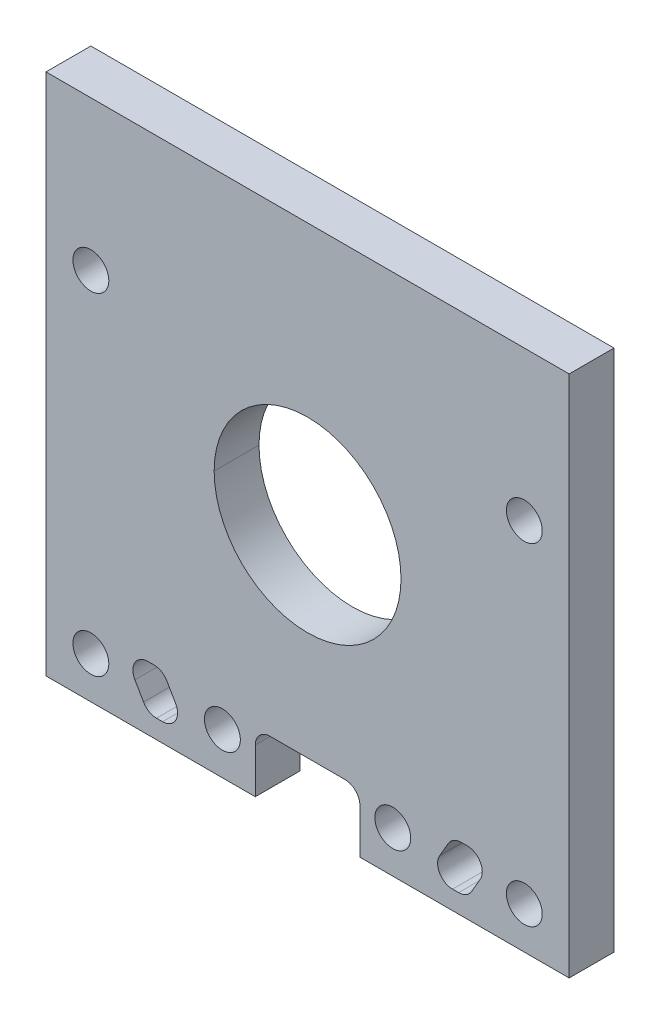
ISO-10303-21;
HEADER;
FILE_DESCRIPTION(('STEP AP214'),'2;1');
FILE_NAME('part.step','',(''),(''),'','','');
FILE_SCHEMA(('AUTOMOTIVE_DESIGN { 1 0 10303 214 1 1 1 1 }'));
ENDSEC;
DATA;
#1=APPLICATION_CONTEXT('core data for automotive mechanical design processes');
#2=APPLICATION_PROTOCOL_DEFINITION('international standard','automotive_design',2000,#1);
#3=PRODUCT_CONTEXT('',#1,'mechanical');
#4=PRODUCT('Part','Part','',(#3));
#5=PRODUCT_RELATED_PRODUCT_CATEGORY('part','',(#4));
#6=PRODUCT_DEFINITION_FORMATION('','',#4);
#7=PRODUCT_DEFINITION_CONTEXT('part definition',#1,'design');
#8=PRODUCT_DEFINITION('design','',#6,#7);
#9=PRODUCT_DEFINITION_SHAPE('','',#8);
#10=(LENGTH_UNIT() NAMED_UNIT(*) SI_UNIT(.MILLI.,.METRE.));
#11=(NAMED_UNIT(*) PLANE_ANGLE_UNIT() SI_UNIT($,.RADIAN.));
#12=(NAMED_UNIT(*) SI_UNIT($,.STERADIAN.) SOLID_ANGLE_UNIT());
#13=UNCERTAINTY_MEASURE_WITH_UNIT(LENGTH_MEASURE(1.E-05),#10,'distance_accuracy_value','');
#14=(GEOMETRIC_REPRESENTATION_CONTEXT(3) GLOBAL_UNCERTAINTY_ASSIGNED_CONTEXT((#13)) GLOBAL_UNIT_ASSIGNED_CONTEXT((#10,
#11,#12)) REPRESENTATION_CONTEXT('',''));
#15=CARTESIAN_POINT('',(0.,0.,0.));
#16=DIRECTION('',(0.,0.,1.));
#17=DIRECTION('',(1.,0.,0.));
#18=AXIS2_PLACEMENT_3D('',#15,#16,#17);
#19=CARTESIAN_POINT('',(17.5,17.5,0.));
#20=DIRECTION('',(0.,0.,1.));
#21=DIRECTION('',(1.,0.,0.));
#22=AXIS2_PLACEMENT_3D('',#19,#20,#21);
#23=CYLINDRICAL_SURFACE('',#22,6.25);
#24=DIRECTION('',(0.,0.,1.));
#25=VECTOR('',#24,1.);
#26=CARTESIAN_POINT('',(11.25,17.5,0.));
#27=LINE('',#26,#25);
#28=CARTESIAN_POINT('',(11.25,17.5,0.));
#29=VERTEX_POINT('',#28);
#30=CARTESIAN_POINT('',(11.25,17.5,3.));
#31=VERTEX_POINT('',#30);
#32=EDGE_CURVE('E270',#29,#31,#27,.T.);
#33=ORIENTED_EDGE('',*,*,#32,.F.);
#34=CARTESIAN_POINT('',(17.5,17.5,0.));
#35=DIRECTION('',(0.,0.,1.));
#36=DIRECTION('',(1.,0.,0.));
#37=AXIS2_PLACEMENT_3D('',#34,#35,#36);
#38=CIRCLE('',#37,6.25);
#39=CARTESIAN_POINT('',(23.75,17.5,0.));
#40=VERTEX_POINT('',#39);
#41=EDGE_CURVE('E534',#40,#29,#38,.T.);
#42=ORIENTED_EDGE('',*,*,#41,.F.);
#43=DIRECTION('',(0.,0.,1.));
#44=VECTOR('',#43,1.);
#45=CARTESIAN_POINT('',(23.75,17.5,0.));
#46=LINE('',#45,#44);
#47=CARTESIAN_POINT('',(23.75,17.5,3.));
#48=VERTEX_POINT('',#47);
#49=EDGE_CURVE('E269',#40,#48,#46,.T.);
#50=ORIENTED_EDGE('',*,*,#49,.T.);
#51=CARTESIAN_POINT('',(17.5,17.5,3.));
#52=DIRECTION('',(0.,0.,1.));
#53=DIRECTION('',(1.,0.,0.));
#54=AXIS2_PLACEMENT_3D('',#51,#52,#53);
#55=CIRCLE('',#54,6.25);
#56=EDGE_CURVE('E368',#48,#31,#55,.T.);
#57=ORIENTED_EDGE('',*,*,#56,.T.);
#58=EDGE_LOOP('',(#33,#42,#50,#57));
#59=FACE_BOUND('',#58,.T.);
#60=ADVANCED_FACE('F38',(#59),#23,.F.);
#61=CARTESIAN_POINT('',(15.,3.,10.));
#62=DIRECTION('',(0.,0.,1.));
#63=DIRECTION('',(1.,0.,0.));
#64=AXIS2_PLACEMENT_3D('',#61,#62,#63);
#65=CYLINDRICAL_SURFACE('',#64,1.);
#66=CARTESIAN_POINT('',(15.,3.,3.));
#67=DIRECTION('',(0.,0.,-1.));
#68=DIRECTION('',(-1.,0.,0.));
#69=AXIS2_PLACEMENT_3D('',#66,#67,#68);
#70=CIRCLE('',#69,1.);
#71=CARTESIAN_POINT('',(14.,3.,3.));
#72=VERTEX_POINT('',#71);
#73=CARTESIAN_POINT('',(15.,4.,3.));
#74=VERTEX_POINT('',#73);
#75=EDGE_CURVE('E315',#72,#74,#70,.T.);
#76=ORIENTED_EDGE('',*,*,#75,.F.);
#77=DIRECTION('',(0.,0.,1.));
#78=VECTOR('',#77,1.);
#79=CARTESIAN_POINT('',(14.,3.,3.));
#80=LINE('',#79,#78);
#81=CARTESIAN_POINT('',(14.,3.,0.));
#82=VERTEX_POINT('',#81);
#83=EDGE_CURVE('E356',#82,#72,#80,.T.);
#84=ORIENTED_EDGE('',*,*,#83,.F.);
#85=CARTESIAN_POINT('',(15.,3.,0.));
#86=DIRECTION('',(0.,0.,1.));
#87=DIRECTION('',(-1.,0.,0.));
#88=AXIS2_PLACEMENT_3D('',#85,#86,#87);
#89=CIRCLE('',#88,1.);
#90=CARTESIAN_POINT('',(15.,4.,0.));
#91=VERTEX_POINT('',#90);
#92=EDGE_CURVE('E398',#91,#82,#89,.T.);
#93=ORIENTED_EDGE('',*,*,#92,.F.);
#94=DIRECTION('',(0.,0.,-1.));
#95=VECTOR('',#94,1.);
#96=CARTESIAN_POINT('',(15.,4.,0.));
#97=LINE('',#96,#95);
#98=EDGE_CURVE('E325',#74,#91,#97,.T.);
#99=ORIENTED_EDGE('',*,*,#98,.F.);
#100=EDGE_LOOP('',(#76,#84,#93,#99));
#101=FACE_BOUND('',#100,.T.);
#102=ADVANCED_FACE('F772',(#101),#65,.F.);
#103=CARTESIAN_POINT('',(20.,3.,10.));
#104=DIRECTION('',(0.,0.,1.));
#105=DIRECTION('',(1.,0.,0.));
#106=AXIS2_PLACEMENT_3D('',#103,#104,#105);
#107=CYLINDRICAL_SURFACE('',#106,1.);
#108=CARTESIAN_POINT('',(20.,3.,3.));
#109=DIRECTION('',(0.,0.,-1.));
#110=DIRECTION('',(-1.,0.,0.));
#111=AXIS2_PLACEMENT_3D('',#108,#109,#110);
#112=CIRCLE('',#111,1.);
#113=CARTESIAN_POINT('',(20.,4.,3.));
#114=VERTEX_POINT('',#113);
#115=CARTESIAN_POINT('',(21.,3.,3.));
#116=VERTEX_POINT('',#115);
#117=EDGE_CURVE('E375',#114,#116,#112,.T.);
#118=ORIENTED_EDGE('',*,*,#117,.F.);
#119=DIRECTION('',(0.,0.,1.));
#120=VECTOR('',#119,1.);
#121=CARTESIAN_POINT('',(20.,4.,3.));
#122=LINE('',#121,#120);
#123=CARTESIAN_POINT('',(20.,4.,0.));
#124=VERTEX_POINT('',#123);
#125=EDGE_CURVE('E321',#124,#114,#122,.T.);
#126=ORIENTED_EDGE('',*,*,#125,.F.);
#127=CARTESIAN_POINT('',(20.,3.,0.));
#128=DIRECTION('',(0.,0.,1.));
#129=DIRECTION('',(-1.,0.,0.));
#130=AXIS2_PLACEMENT_3D('',#127,#128,#129);
#131=CIRCLE('',#130,1.);
#132=CARTESIAN_POINT('',(21.,3.,0.));
#133=VERTEX_POINT('',#132);
#134=EDGE_CURVE('E399',#133,#124,#131,.T.);
#135=ORIENTED_EDGE('',*,*,#134,.F.);
#136=DIRECTION('',(0.,0.,-1.));
#137=VECTOR('',#136,1.);
#138=CARTESIAN_POINT('',(21.,3.,0.));
#139=LINE('',#138,#137);
#140=EDGE_CURVE('E312',#116,#133,#139,.T.);
#141=ORIENTED_EDGE('',*,*,#140,.F.);
#142=EDGE_LOOP('',(#118,#126,#135,#141));
#143=FACE_BOUND('',#142,.T.);
#144=ADVANCED_FACE('F696',(#143),#107,.F.);
#145=CARTESIAN_POINT('',(7.22264973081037,3.25,10.));
#146=DIRECTION('',(0.,0.,1.));
#147=DIRECTION('',(1.,0.,0.));
#148=AXIS2_PLACEMENT_3D('',#145,#146,#147);
#149=CYLINDRICAL_SURFACE('',#148,1.);
#150=CARTESIAN_POINT('',(7.22264973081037,3.25,3.));
#151=DIRECTION('',(0.,0.,-1.));
#152=DIRECTION('',(-1.,0.,0.));
#153=AXIS2_PLACEMENT_3D('',#150,#151,#152);
#154=CIRCLE('',#153,1.);
#155=CARTESIAN_POINT('',(7.22264973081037,4.25,3.));
#156=VERTEX_POINT('',#155);
#157=CARTESIAN_POINT('',(8.0886751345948,3.75,3.));
#158=VERTEX_POINT('',#157);
#159=EDGE_CURVE('E236',#156,#158,#154,.T.);
#160=ORIENTED_EDGE('',*,*,#159,.F.);
#161=DIRECTION('',(0.,0.,1.));
#162=VECTOR('',#161,1.);
#163=CARTESIAN_POINT('',(7.22264973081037,4.25,3.));
#164=LINE('',#163,#162);
#165=CARTESIAN_POINT('',(7.22264973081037,4.25,0.));
#166=VERTEX_POINT('',#165);
#167=EDGE_CURVE('E11',#166,#156,#164,.T.);
#168=ORIENTED_EDGE('',*,*,#167,.F.);
#169=CARTESIAN_POINT('',(7.22264973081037,3.25,0.));
#170=DIRECTION('',(0.,0.,1.));
#171=DIRECTION('',(-1.,0.,0.));
#172=AXIS2_PLACEMENT_3D('',#169,#170,#171);
#173=CIRCLE('',#172,1.);
#174=CARTESIAN_POINT('',(8.0886751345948,3.75,0.));
#175=VERTEX_POINT('',#174);
#176=EDGE_CURVE('E651',#175,#166,#173,.T.);
#177=ORIENTED_EDGE('',*,*,#176,.F.);
#178=DIRECTION('',(0.,0.,-1.));
#179=VECTOR('',#178,1.);
#180=CARTESIAN_POINT('',(8.0886751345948,3.75,0.));
#181=LINE('',#180,#179);
#182=EDGE_CURVE('E239',#158,#175,#181,.T.);
#183=ORIENTED_EDGE('',*,*,#182,.F.);
#184=EDGE_LOOP('',(#160,#168,#177,#183));
#185=FACE_BOUND('',#184,.T.);
#186=ADVANCED_FACE('F237',(#185),#149,.F.);
#187=CARTESIAN_POINT('',(6.8138583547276,3.25,10.));
#188=DIRECTION('',(0.,0.,1.));
#189=DIRECTION('',(1.,0.,0.));
#190=AXIS2_PLACEMENT_3D('',#187,#188,#189);
#191=CYLINDRICAL_SURFACE('',#190,1.);
#192=CARTESIAN_POINT('',(6.8138583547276,3.25,3.));
#193=DIRECTION('',(0.,0.,-1.));
#194=DIRECTION('',(-1.,0.,0.));
#195=AXIS2_PLACEMENT_3D('',#192,#193,#194);
#196=CIRCLE('',#195,1.);
#197=CARTESIAN_POINT('',(5.94783295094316,2.74999999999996,3.));
#198=VERTEX_POINT('',#197);
#199=CARTESIAN_POINT('',(6.8138583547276,4.25,3.));
#200=VERTEX_POINT('',#199);
#201=EDGE_CURVE('E250',#198,#200,#196,.T.);
#202=ORIENTED_EDGE('',*,*,#201,.F.);
#203=DIRECTION('',(0.,0.,1.));
#204=VECTOR('',#203,1.);
#205=CARTESIAN_POINT('',(5.94783295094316,2.75,3.));
#206=LINE('',#205,#204);
#207=CARTESIAN_POINT('',(5.94783295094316,2.74999999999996,0.));
#208=VERTEX_POINT('',#207);
#209=EDGE_CURVE('E283',#208,#198,#206,.T.);
#210=ORIENTED_EDGE('',*,*,#209,.F.);
#211=CARTESIAN_POINT('',(6.8138583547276,3.25,0.));
#212=DIRECTION('',(0.,0.,1.));
#213=DIRECTION('',(-1.,0.,0.));
#214=AXIS2_PLACEMENT_3D('',#211,#212,#213);
#215=CIRCLE('',#214,1.);
#216=CARTESIAN_POINT('',(6.8138583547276,4.25,0.));
#217=VERTEX_POINT('',#216);
#218=EDGE_CURVE('E360',#217,#208,#215,.T.);
#219=ORIENTED_EDGE('',*,*,#218,.F.);
#220=DIRECTION('',(0.,0.,-1.));
#221=VECTOR('',#220,1.);
#222=CARTESIAN_POINT('',(6.8138583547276,4.25,0.));
#223=LINE('',#222,#221);
#224=EDGE_CURVE('E49',#200,#217,#223,.T.);
#225=ORIENTED_EDGE('',*,*,#224,.F.);
#226=EDGE_LOOP('',(#202,#210,#219,#225));
#227=FACE_BOUND('',#226,.T.);
#228=ADVANCED_FACE('F839',(#227),#191,.F.);
#229=CARTESIAN_POINT('',(7.39120862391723,2.24999999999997,10.));
#230=DIRECTION('',(0.,0.,1.));
#231=DIRECTION('',(1.,0.,0.));
#232=AXIS2_PLACEMENT_3D('',#229,#230,#231);
#233=CYLINDRICAL_SURFACE('',#232,1.);
#234=CARTESIAN_POINT('',(7.39120862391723,2.24999999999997,3.));
#235=DIRECTION('',(0.,0.,-1.));
#236=DIRECTION('',(-1.,0.,0.));
#237=AXIS2_PLACEMENT_3D('',#234,#235,#236);
#238=CIRCLE('',#237,1.);
#239=CARTESIAN_POINT('',(7.39120862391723,1.24999999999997,3.));
#240=VERTEX_POINT('',#239);
#241=CARTESIAN_POINT('',(6.52518322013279,1.74999999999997,3.));
#242=VERTEX_POINT('',#241);
#243=EDGE_CURVE('E281',#240,#242,#238,.T.);
#244=ORIENTED_EDGE('',*,*,#243,.F.);
#245=DIRECTION('',(0.,0.,1.));
#246=VECTOR('',#245,1.);
#247=CARTESIAN_POINT('',(7.39120862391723,1.24999999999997,3.));
#248=LINE('',#247,#246);
#249=CARTESIAN_POINT('',(7.39120862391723,1.24999999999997,0.));
#250=VERTEX_POINT('',#249);
#251=EDGE_CURVE('E500',#250,#240,#248,.T.);
#252=ORIENTED_EDGE('',*,*,#251,.F.);
#253=CARTESIAN_POINT('',(7.39120862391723,2.24999999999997,0.));
#254=DIRECTION('',(0.,0.,1.));
#255=DIRECTION('',(-1.,0.,0.));
#256=AXIS2_PLACEMENT_3D('',#253,#254,#255);
#257=CIRCLE('',#256,1.);
#258=CARTESIAN_POINT('',(6.52518322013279,1.74999999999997,0.));
#259=VERTEX_POINT('',#258);
#260=EDGE_CURVE('E42',#259,#250,#257,.T.);
#261=ORIENTED_EDGE('',*,*,#260,.F.);
#262=DIRECTION('',(0.,0.,-1.));
#263=VECTOR('',#262,1.);
#264=CARTESIAN_POINT('',(6.52518322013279,1.74999999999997,0.));
#265=LINE('',#264,#263);
#266=EDGE_CURVE('E287',#242,#259,#265,.T.);
#267=ORIENTED_EDGE('',*,*,#266,.F.);
#268=EDGE_LOOP('',(#244,#252,#261,#267));
#269=FACE_BOUND('',#268,.T.);
#270=ADVANCED_FACE('F604',(#269),#233,.F.);
#271=CARTESIAN_POINT('',(7.8,2.24999999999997,10.));
#272=DIRECTION('',(0.,0.,1.));
#273=DIRECTION('',(1.,0.,0.));
#274=AXIS2_PLACEMENT_3D('',#271,#272,#273);
#275=CYLINDRICAL_SURFACE('',#274,1.);
#276=DIRECTION('',(0.,0.,1.));
#277=VECTOR('',#276,1.);
#278=CARTESIAN_POINT('',(8.8,2.24999999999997,10.));
#279=LINE('',#278,#277);
#280=CARTESIAN_POINT('',(8.8,2.24999999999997,0.));
#281=VERTEX_POINT('',#280);
#282=CARTESIAN_POINT('',(8.8,2.24999999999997,3.));
#283=VERTEX_POINT('',#282);
#284=EDGE_CURVE('E331',#281,#283,#279,.T.);
#285=ORIENTED_EDGE('',*,*,#284,.F.);
#286=CARTESIAN_POINT('',(7.8,2.24999999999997,0.));
#287=DIRECTION('',(0.,0.,1.));
#288=DIRECTION('',(-1.,0.,0.));
#289=AXIS2_PLACEMENT_3D('',#286,#287,#288);
#290=CIRCLE('',#289,1.);
#291=CARTESIAN_POINT('',(7.8,1.24999999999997,0.));
#292=VERTEX_POINT('',#291);
#293=EDGE_CURVE('E380',#292,#281,#290,.T.);
#294=ORIENTED_EDGE('',*,*,#293,.F.);
#295=DIRECTION('',(0.,0.,-1.));
#296=VECTOR('',#295,1.);
#297=CARTESIAN_POINT('',(7.8,1.24999999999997,0.));
#298=LINE('',#297,#296);
#299=CARTESIAN_POINT('',(7.8,1.24999999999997,3.));
#300=VERTEX_POINT('',#299);
#301=EDGE_CURVE('E286',#300,#292,#298,.T.);
#302=ORIENTED_EDGE('',*,*,#301,.F.);
#303=CARTESIAN_POINT('',(7.8,2.24999999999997,3.));
#304=DIRECTION('',(0.,0.,-1.));
#305=DIRECTION('',(-1.,0.,0.));
#306=AXIS2_PLACEMENT_3D('',#303,#304,#305);
#307=CIRCLE('',#306,1.);
#308=EDGE_CURVE('E282',#283,#300,#307,.T.);
#309=ORIENTED_EDGE('',*,*,#308,.F.);
#310=EDGE_LOOP('',(#285,#294,#302,#309));
#311=FACE_BOUND('',#310,.T.);
#312=ADVANCED_FACE('F618',(#311),#275,.F.);
#313=CARTESIAN_POINT('',(27.7773502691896,3.25,10.));
#314=DIRECTION('',(0.,0.,1.));
#315=DIRECTION('',(1.,0.,0.));
#316=AXIS2_PLACEMENT_3D('',#313,#314,#315);
#317=CYLINDRICAL_SURFACE('',#316,1.);
#318=CARTESIAN_POINT('',(27.7773502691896,3.25,3.));
#319=DIRECTION('',(0.,0.,-1.));
#320=DIRECTION('',(-1.,0.,0.));
#321=AXIS2_PLACEMENT_3D('',#318,#319,#320);
#322=CIRCLE('',#321,1.);
#323=CARTESIAN_POINT('',(26.9113248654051,3.75,3.));
#324=VERTEX_POINT('',#323);
#325=CARTESIAN_POINT('',(27.7773502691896,4.25,3.));
#326=VERTEX_POINT('',#325);
#327=EDGE_CURVE('E444',#324,#326,#322,.T.);
#328=ORIENTED_EDGE('',*,*,#327,.F.);
#329=DIRECTION('',(0.,0.,1.));
#330=VECTOR('',#329,1.);
#331=CARTESIAN_POINT('',(26.9113248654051,3.75,3.));
#332=LINE('',#331,#330);
#333=CARTESIAN_POINT('',(26.9113248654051,3.75,0.));
#334=VERTEX_POINT('',#333);
#335=EDGE_CURVE('E371',#334,#324,#332,.T.);
#336=ORIENTED_EDGE('',*,*,#335,.F.);
#337=CARTESIAN_POINT('',(27.7773502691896,3.25,0.));
#338=DIRECTION('',(0.,0.,1.));
#339=DIRECTION('',(-1.,0.,0.));
#340=AXIS2_PLACEMENT_3D('',#337,#338,#339);
#341=CIRCLE('',#340,1.);
#342=CARTESIAN_POINT('',(27.7773502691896,4.25,0.));
#343=VERTEX_POINT('',#342);
#344=EDGE_CURVE('E505',#343,#334,#341,.T.);
#345=ORIENTED_EDGE('',*,*,#344,.F.);
#346=DIRECTION('',(0.,0.,-1.));
#347=VECTOR('',#346,1.);
#348=CARTESIAN_POINT('',(27.7773502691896,4.25,0.));
#349=LINE('',#348,#347);
#350=EDGE_CURVE('E468',#326,#343,#349,.T.);
#351=ORIENTED_EDGE('',*,*,#350,.F.);
#352=EDGE_LOOP('',(#328,#336,#345,#351));
#353=FACE_BOUND('',#352,.T.);
#354=ADVANCED_FACE('F833',(#353),#317,.F.);
#355=CARTESIAN_POINT('',(28.1861416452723,3.25,10.));
#356=DIRECTION('',(0.,0.,1.));
#357=DIRECTION('',(1.,0.,0.));
#358=AXIS2_PLACEMENT_3D('',#355,#356,#357);
#359=CYLINDRICAL_SURFACE('',#358,1.);
#360=DIRECTION('',(0.,0.,1.));
#361=VECTOR('',#360,1.);
#362=CARTESIAN_POINT('',(29.1861416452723,3.25,10.));
#363=LINE('',#362,#361);
#364=CARTESIAN_POINT('',(29.1861416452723,3.25,0.));
#365=VERTEX_POINT('',#364);
#366=CARTESIAN_POINT('',(29.1861416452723,3.25,3.));
#367=VERTEX_POINT('',#366);
#368=EDGE_CURVE('E389',#365,#367,#363,.T.);
#369=ORIENTED_EDGE('',*,*,#368,.F.);
#370=CARTESIAN_POINT('',(28.1861416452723,3.25,0.));
#371=DIRECTION('',(0.,0.,1.));
#372=DIRECTION('',(-1.,0.,0.));
#373=AXIS2_PLACEMENT_3D('',#370,#371,#372);
#374=CIRCLE('',#373,1.);
#375=CARTESIAN_POINT('',(29.0521670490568,2.74999999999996,0.));
#376=VERTEX_POINT('',#375);
#377=EDGE_CURVE('E478',#376,#365,#374,.T.);
#378=ORIENTED_EDGE('',*,*,#377,.F.);
#379=DIRECTION('',(0.,0.,-1.));
#380=VECTOR('',#379,1.);
#381=CARTESIAN_POINT('',(29.0521670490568,2.74999999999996,0.));
#382=LINE('',#381,#380);
#383=CARTESIAN_POINT('',(29.0521670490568,2.74999999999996,3.));
#384=VERTEX_POINT('',#383);
#385=EDGE_CURVE('E459',#384,#376,#382,.T.);
#386=ORIENTED_EDGE('',*,*,#385,.F.);
#387=CARTESIAN_POINT('',(28.1861416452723,3.25,3.));
#388=DIRECTION('',(0.,0.,-1.));
#389=DIRECTION('',(-1.,0.,0.));
#390=AXIS2_PLACEMENT_3D('',#387,#388,#389);
#391=CIRCLE('',#390,1.);
#392=EDGE_CURVE('E297',#367,#384,#391,.T.);
#393=ORIENTED_EDGE('',*,*,#392,.F.);
#394=EDGE_LOOP('',(#369,#378,#386,#393));
#395=FACE_BOUND('',#394,.T.);
#396=ADVANCED_FACE('F756',(#395),#359,.F.);
#397=CARTESIAN_POINT('',(27.6087913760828,2.24999999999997,10.));
#398=DIRECTION('',(0.,0.,1.));
#399=DIRECTION('',(1.,0.,0.));
#400=AXIS2_PLACEMENT_3D('',#397,#398,#399);
#401=CYLINDRICAL_SURFACE('',#400,1.);
#402=CARTESIAN_POINT('',(27.6087913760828,2.24999999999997,3.));
#403=DIRECTION('',(0.,0.,-1.));
#404=DIRECTION('',(-1.,0.,0.));
#405=AXIS2_PLACEMENT_3D('',#402,#403,#404);
#406=CIRCLE('',#405,1.);
#407=CARTESIAN_POINT('',(28.4748167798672,1.74999999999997,3.));
#408=VERTEX_POINT('',#407);
#409=CARTESIAN_POINT('',(27.6087913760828,1.24999999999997,3.));
#410=VERTEX_POINT('',#409);
#411=EDGE_CURVE('E490',#408,#410,#406,.T.);
#412=ORIENTED_EDGE('',*,*,#411,.F.);
#413=DIRECTION('',(0.,0.,1.));
#414=VECTOR('',#413,1.);
#415=CARTESIAN_POINT('',(28.4748167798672,1.74999999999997,3.));
#416=LINE('',#415,#414);
#417=CARTESIAN_POINT('',(28.4748167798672,1.74999999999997,0.));
#418=VERTEX_POINT('',#417);
#419=EDGE_CURVE('E402',#418,#408,#416,.T.);
#420=ORIENTED_EDGE('',*,*,#419,.F.);
#421=CARTESIAN_POINT('',(27.6087913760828,2.24999999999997,0.));
#422=DIRECTION('',(0.,0.,1.));
#423=DIRECTION('',(-1.,0.,0.));
#424=AXIS2_PLACEMENT_3D('',#421,#422,#423);
#425=CIRCLE('',#424,1.);
#426=CARTESIAN_POINT('',(27.6087913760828,1.24999999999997,0.));
#427=VERTEX_POINT('',#426);
#428=EDGE_CURVE('E480',#427,#418,#425,.T.);
#429=ORIENTED_EDGE('',*,*,#428,.F.);
#430=DIRECTION('',(0.,0.,-1.));
#431=VECTOR('',#430,1.);
#432=CARTESIAN_POINT('',(27.6087913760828,1.24999999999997,0.));
#433=LINE('',#432,#431);
#434=EDGE_CURVE('E311',#410,#427,#433,.T.);
#435=ORIENTED_EDGE('',*,*,#434,.F.);
#436=EDGE_LOOP('',(#412,#420,#429,#435));
#437=FACE_BOUND('',#436,.T.);
#438=ADVANCED_FACE('F832',(#437),#401,.F.);
#439=CARTESIAN_POINT('',(27.2,2.24999999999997,10.));
#440=DIRECTION('',(0.,0.,1.));
#441=DIRECTION('',(1.,0.,0.));
#442=AXIS2_PLACEMENT_3D('',#439,#440,#441);
#443=CYLINDRICAL_SURFACE('',#442,1.);
#444=CARTESIAN_POINT('',(27.2,2.24999999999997,3.));
#445=DIRECTION('',(0.,0.,-1.));
#446=DIRECTION('',(-1.,0.,0.));
#447=AXIS2_PLACEMENT_3D('',#444,#445,#446);
#448=CIRCLE('',#447,1.);
#449=CARTESIAN_POINT('',(27.2,1.24999999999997,3.));
#450=VERTEX_POINT('',#449);
#451=CARTESIAN_POINT('',(26.3339745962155,2.75,3.));
#452=VERTEX_POINT('',#451);
#453=EDGE_CURVE('E407',#450,#452,#448,.T.);
#454=ORIENTED_EDGE('',*,*,#453,.F.);
#455=DIRECTION('',(0.,0.,1.));
#456=VECTOR('',#455,1.);
#457=CARTESIAN_POINT('',(27.2,1.24999999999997,3.));
#458=LINE('',#457,#456);
#459=CARTESIAN_POINT('',(27.2,1.24999999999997,0.));
#460=VERTEX_POINT('',#459);
#461=EDGE_CURVE('E308',#460,#450,#458,.T.);
#462=ORIENTED_EDGE('',*,*,#461,.F.);
#463=CARTESIAN_POINT('',(27.2,2.24999999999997,0.));
#464=DIRECTION('',(0.,0.,1.));
#465=DIRECTION('',(-1.,0.,0.));
#466=AXIS2_PLACEMENT_3D('',#463,#464,#465);
#467=CIRCLE('',#466,1.);
#468=CARTESIAN_POINT('',(26.3339745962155,2.75,0.));
#469=VERTEX_POINT('',#468);
#470=EDGE_CURVE('E326',#469,#460,#467,.T.);
#471=ORIENTED_EDGE('',*,*,#470,.F.);
#472=DIRECTION('',(0.,0.,-1.));
#473=VECTOR('',#472,1.);
#474=CARTESIAN_POINT('',(26.3339745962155,2.75,0.));
#475=LINE('',#474,#473);
#476=EDGE_CURVE('E62',#452,#469,#475,.T.);
#477=ORIENTED_EDGE('',*,*,#476,.F.);
#478=EDGE_LOOP('',(#454,#462,#471,#477));
#479=FACE_BOUND('',#478,.T.);
#480=ADVANCED_FACE('F850',(#479),#443,.F.);
#481=CARTESIAN_POINT('',(5.08180754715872,4.25,10.));
#482=DIRECTION('',(0.,1.,0.));
#483=DIRECTION('',(1.,0.,0.));
#484=AXIS2_PLACEMENT_3D('',#481,#482,#483);
#485=PLANE('',#484);
#486=DIRECTION('',(1.,0.,0.));
#487=VECTOR('',#486,1.);
#488=CARTESIAN_POINT('',(0.,4.25,3.));
#489=LINE('',#488,#487);
#490=EDGE_CURVE('E227',#200,#156,#489,.T.);
#491=ORIENTED_EDGE('',*,*,#490,.F.);
#492=ORIENTED_EDGE('',*,*,#224,.T.);
#493=DIRECTION('',(1.,0.,0.));
#494=VECTOR('',#493,1.);
#495=CARTESIAN_POINT('',(5.08180754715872,4.25,0.));
#496=LINE('',#495,#494);
#497=EDGE_CURVE('E230',#217,#166,#496,.T.);
#498=ORIENTED_EDGE('',*,*,#497,.T.);
#499=ORIENTED_EDGE('',*,*,#167,.T.);
#500=EDGE_LOOP('',(#491,#492,#498,#499));
#501=FACE_BOUND('',#500,.T.);
#502=ADVANCED_FACE('F224',(#501),#485,.F.);
#503=CARTESIAN_POINT('',(7.8,4.25,10.));
#504=DIRECTION('',(0.866025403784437,0.5,0.));
#505=DIRECTION('',(0.,0.,-1.));
#506=AXIS2_PLACEMENT_3D('',#503,#504,#505);
#507=PLANE('',#506);
#508=DIRECTION('',(0.5,-0.866025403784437,0.));
#509=VECTOR('',#508,1.);
#510=CARTESIAN_POINT('',(7.8,4.25,0.));
#511=LINE('',#510,#509);
#512=CARTESIAN_POINT('',(8.66602540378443,2.75,0.));
#513=VERTEX_POINT('',#512);
#514=EDGE_CURVE('E548',#175,#513,#511,.T.);
#515=ORIENTED_EDGE('',*,*,#514,.T.);
#516=DIRECTION('',(0.,0.,1.));
#517=VECTOR('',#516,1.);
#518=CARTESIAN_POINT('',(8.66602540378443,2.75,3.));
#519=LINE('',#518,#517);
#520=CARTESIAN_POINT('',(8.66602540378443,2.75,3.));
#521=VERTEX_POINT('',#520);
#522=EDGE_CURVE('E406',#513,#521,#519,.T.);
#523=ORIENTED_EDGE('',*,*,#522,.T.);
#524=DIRECTION('',(0.5,-0.866025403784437,0.));
#525=VECTOR('',#524,1.);
#526=CARTESIAN_POINT('',(7.69030398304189,4.43999907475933,3.));
#527=LINE('',#526,#525);
#528=EDGE_CURVE('E365',#158,#521,#527,.T.);
#529=ORIENTED_EDGE('',*,*,#528,.F.);
#530=ORIENTED_EDGE('',*,*,#182,.T.);
#531=EDGE_LOOP('',(#515,#523,#529,#530));
#532=FACE_BOUND('',#531,.T.);
#533=ADVANCED_FACE('F874',(#532),#507,.F.);
#534=CARTESIAN_POINT('',(9.53205080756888,1.24999999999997,10.));
#535=DIRECTION('',(0.,-1.,0.));
#536=DIRECTION('',(-1.,0.,0.));
#537=AXIS2_PLACEMENT_3D('',#534,#535,#536);
#538=PLANE('',#537);
#539=DIRECTION('',(-1.,0.,0.));
#540=VECTOR('',#539,1.);
#541=CARTESIAN_POINT('',(0.,1.24999999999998,3.));
#542=LINE('',#541,#540);
#543=EDGE_CURVE('E277',#300,#240,#542,.T.);
#544=ORIENTED_EDGE('',*,*,#543,.F.);
#545=ORIENTED_EDGE('',*,*,#301,.T.);
#546=DIRECTION('',(-1.,0.,0.));
#547=VECTOR('',#546,1.);
#548=CARTESIAN_POINT('',(9.53205080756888,1.24999999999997,0.));
#549=LINE('',#548,#547);
#550=EDGE_CURVE('E376',#292,#250,#549,.T.);
#551=ORIENTED_EDGE('',*,*,#550,.T.);
#552=ORIENTED_EDGE('',*,*,#251,.T.);
#553=EDGE_LOOP('',(#544,#545,#551,#552));
#554=FACE_BOUND('',#553,.T.);
#555=ADVANCED_FACE('F610',(#554),#538,.F.);
#556=CARTESIAN_POINT('',(6.81385835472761,1.24999999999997,10.));
#557=DIRECTION('',(-0.866025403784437,-0.5,0.));
#558=DIRECTION('',(-0.5,0.866025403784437,0.));
#559=AXIS2_PLACEMENT_3D('',#556,#557,#558);
#560=PLANE('',#559);
#561=DIRECTION('',(-0.5,0.866025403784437,0.));
#562=VECTOR('',#561,1.);
#563=CARTESIAN_POINT('',(5.65165964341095,3.26298721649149,3.));
#564=LINE('',#563,#562);
#565=EDGE_CURVE('E256',#242,#198,#564,.T.);
#566=ORIENTED_EDGE('',*,*,#565,.F.);
#567=ORIENTED_EDGE('',*,*,#266,.T.);
#568=DIRECTION('',(-0.5,0.866025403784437,0.));
#569=VECTOR('',#568,1.);
#570=CARTESIAN_POINT('',(6.81385835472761,1.24999999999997,0.));
#571=LINE('',#570,#569);
#572=EDGE_CURVE('E537',#259,#208,#571,.T.);
#573=ORIENTED_EDGE('',*,*,#572,.T.);
#574=ORIENTED_EDGE('',*,*,#209,.T.);
#575=EDGE_LOOP('',(#566,#567,#573,#574));
#576=FACE_BOUND('',#575,.T.);
#577=ADVANCED_FACE('F888',(#576),#560,.F.);
#578=CARTESIAN_POINT('',(27.2,4.25,10.));
#579=DIRECTION('',(-0.866025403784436,0.5,0.));
#580=DIRECTION('',(0.,0.,1.));
#581=AXIS2_PLACEMENT_3D('',#578,#579,#580);
#582=PLANE('',#581);
#583=DIRECTION('',(0.5,0.866025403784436,0.));
#584=VECTOR('',#583,1.);
#585=CARTESIAN_POINT('',(18.559696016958,-10.7154454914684,3.));
#586=LINE('',#585,#584);
#587=EDGE_CURVE('E411',#452,#324,#586,.T.);
#588=ORIENTED_EDGE('',*,*,#587,.F.);
#589=ORIENTED_EDGE('',*,*,#476,.T.);
#590=DIRECTION('',(0.5,0.866025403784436,0.));
#591=VECTOR('',#590,1.);
#592=CARTESIAN_POINT('',(27.2,4.25,0.));
#593=LINE('',#592,#591);
#594=EDGE_CURVE('E448',#469,#334,#593,.T.);
#595=ORIENTED_EDGE('',*,*,#594,.T.);
#596=ORIENTED_EDGE('',*,*,#335,.T.);
#597=EDGE_LOOP('',(#588,#589,#595,#596));
#598=FACE_BOUND('',#597,.T.);
#599=ADVANCED_FACE('F767',(#598),#582,.F.);
#600=CARTESIAN_POINT('',(27.2,4.25,10.));
#601=DIRECTION('',(0.,1.,0.));
#602=DIRECTION('',(1.,0.,0.));
#603=AXIS2_PLACEMENT_3D('',#600,#601,#602);
#604=PLANE('',#603);
#605=DIRECTION('',(1.,0.,0.));
#606=VECTOR('',#605,1.);
#607=CARTESIAN_POINT('',(27.2,4.25,0.));
#608=LINE('',#607,#606);
#609=CARTESIAN_POINT('',(28.1861416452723,4.25,0.));
#610=VERTEX_POINT('',#609);
#611=EDGE_CURVE('E553',#343,#610,#608,.T.);
#612=ORIENTED_EDGE('',*,*,#611,.T.);
#613=DIRECTION('',(0.,0.,1.));
#614=VECTOR('',#613,1.);
#615=CARTESIAN_POINT('',(28.1861416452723,4.25,3.));
#616=LINE('',#615,#614);
#617=CARTESIAN_POINT('',(28.1861416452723,4.25,3.));
#618=VERTEX_POINT('',#617);
#619=EDGE_CURVE('E260',#610,#618,#616,.T.);
#620=ORIENTED_EDGE('',*,*,#619,.T.);
#621=DIRECTION('',(1.,0.,0.));
#622=VECTOR('',#621,1.);
#623=CARTESIAN_POINT('',(0.,4.24999999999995,3.));
#624=LINE('',#623,#622);
#625=EDGE_CURVE('E244',#326,#618,#624,.T.);
#626=ORIENTED_EDGE('',*,*,#625,.F.);
#627=ORIENTED_EDGE('',*,*,#350,.T.);
#628=EDGE_LOOP('',(#612,#620,#626,#627));
#629=FACE_BOUND('',#628,.T.);
#630=ADVANCED_FACE('F751',(#629),#604,.F.);
#631=CARTESIAN_POINT('',(29.9181924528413,4.25,10.));
#632=DIRECTION('',(0.866025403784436,-0.5,0.));
#633=DIRECTION('',(0.,0.,-1.));
#634=AXIS2_PLACEMENT_3D('',#631,#632,#633);
#635=PLANE('',#634);
#636=DIRECTION('',(-0.5,-0.866025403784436,0.));
#637=VECTOR('',#636,1.);
#638=CARTESIAN_POINT('',(29.9181924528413,4.25,0.));
#639=LINE('',#638,#637);
#640=EDGE_CURVE('E483',#376,#418,#639,.T.);
#641=ORIENTED_EDGE('',*,*,#640,.T.);
#642=ORIENTED_EDGE('',*,*,#419,.T.);
#643=DIRECTION('',(-0.5,-0.866025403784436,0.));
#644=VECTOR('',#643,1.);
#645=CARTESIAN_POINT('',(20.5983403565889,-11.8924573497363,3.));
#646=LINE('',#645,#644);
#647=EDGE_CURVE('E456',#384,#408,#646,.T.);
#648=ORIENTED_EDGE('',*,*,#647,.F.);
#649=ORIENTED_EDGE('',*,*,#385,.T.);
#650=EDGE_LOOP('',(#641,#642,#648,#649));
#651=FACE_BOUND('',#650,.T.);
#652=ADVANCED_FACE('F757',(#651),#635,.F.);
#653=CARTESIAN_POINT('',(25.4679491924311,1.24999999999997,10.));
#654=DIRECTION('',(0.,-1.,0.));
#655=DIRECTION('',(-1.,0.,0.));
#656=AXIS2_PLACEMENT_3D('',#653,#654,#655);
#657=PLANE('',#656);
#658=DIRECTION('',(-1.,0.,0.));
#659=VECTOR('',#658,1.);
#660=CARTESIAN_POINT('',(25.4679491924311,1.24999999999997,0.));
#661=LINE('',#660,#659);
#662=EDGE_CURVE('E364',#427,#460,#661,.T.);
#663=ORIENTED_EDGE('',*,*,#662,.T.);
#664=ORIENTED_EDGE('',*,*,#461,.T.);
#665=DIRECTION('',(-1.,0.,0.));
#666=VECTOR('',#665,1.);
#667=CARTESIAN_POINT('',(0.,1.24999999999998,3.));
#668=LINE('',#667,#666);
#669=EDGE_CURVE('E412',#410,#450,#668,.T.);
#670=ORIENTED_EDGE('',*,*,#669,.F.);
#671=ORIENTED_EDGE('',*,*,#434,.T.);
#672=EDGE_LOOP('',(#663,#664,#670,#671));
#673=FACE_BOUND('',#672,.T.);
#674=ADVANCED_FACE('F759',(#673),#657,.F.);
#675=CARTESIAN_POINT('',(21.,4.,10.));
#676=DIRECTION('',(1.,0.,0.));
#677=DIRECTION('',(0.,1.,0.));
#678=AXIS2_PLACEMENT_3D('',#675,#676,#677);
#679=PLANE('',#678);
#680=DIRECTION('',(0.,-1.,0.));
#681=VECTOR('',#680,1.);
#682=CARTESIAN_POINT('',(21.,0.,3.));
#683=LINE('',#682,#681);
#684=CARTESIAN_POINT('',(21.,0.,3.));
#685=VERTEX_POINT('',#684);
#686=EDGE_CURVE('E513',#116,#685,#683,.T.);
#687=ORIENTED_EDGE('',*,*,#686,.F.);
#688=ORIENTED_EDGE('',*,*,#140,.T.);
#689=DIRECTION('',(0.,-1.,0.));
#690=VECTOR('',#689,1.);
#691=CARTESIAN_POINT('',(21.,4.,0.));
#692=LINE('',#691,#690);
#693=CARTESIAN_POINT('',(21.,0.,0.));
#694=VERTEX_POINT('',#693);
#695=EDGE_CURVE('E443',#133,#694,#692,.T.);
#696=ORIENTED_EDGE('',*,*,#695,.T.);
#697=DIRECTION('',(0.,0.,-1.));
#698=VECTOR('',#697,1.);
#699=CARTESIAN_POINT('',(21.,0.,10.));
#700=LINE('',#699,#698);
#701=EDGE_CURVE('E292',#685,#694,#700,.T.);
#702=ORIENTED_EDGE('',*,*,#701,.F.);
#703=EDGE_LOOP('',(#687,#688,#696,#702));
#704=FACE_BOUND('',#703,.T.);
#705=ADVANCED_FACE('F673',(#704),#679,.F.);
#706=CARTESIAN_POINT('',(14.,0.,10.));
#707=DIRECTION('',(-1.,0.,0.));
#708=DIRECTION('',(0.,0.,1.));
#709=AXIS2_PLACEMENT_3D('',#706,#707,#708);
#710=PLANE('',#709);
#711=DIRECTION('',(0.,1.,0.));
#712=VECTOR('',#711,1.);
#713=CARTESIAN_POINT('',(14.,0.,0.));
#714=LINE('',#713,#712);
#715=CARTESIAN_POINT('',(14.,0.,0.));
#716=VERTEX_POINT('',#715);
#717=EDGE_CURVE('E439',#716,#82,#714,.T.);
#718=ORIENTED_EDGE('',*,*,#717,.T.);
#719=ORIENTED_EDGE('',*,*,#83,.T.);
#720=DIRECTION('',(0.,1.,0.));
#721=VECTOR('',#720,1.);
#722=CARTESIAN_POINT('',(14.,0.,3.));
#723=LINE('',#722,#721);
#724=CARTESIAN_POINT('',(14.,0.,3.));
#725=VERTEX_POINT('',#724);
#726=EDGE_CURVE('E320',#725,#72,#723,.T.);
#727=ORIENTED_EDGE('',*,*,#726,.F.);
#728=DIRECTION('',(0.,0.,-1.));
#729=VECTOR('',#728,1.);
#730=CARTESIAN_POINT('',(14.,0.,10.));
#731=LINE('',#730,#729);
#732=EDGE_CURVE('E271',#725,#716,#731,.T.);
#733=ORIENTED_EDGE('',*,*,#732,.T.);
#734=EDGE_LOOP('',(#718,#719,#727,#733));
#735=FACE_BOUND('',#734,.T.);
#736=ADVANCED_FACE('F783',(#735),#710,.F.);
#737=CARTESIAN_POINT('',(14.,4.,10.));
#738=DIRECTION('',(0.,1.,0.));
#739=DIRECTION('',(1.,0.,0.));
#740=AXIS2_PLACEMENT_3D('',#737,#738,#739);
#741=PLANE('',#740);
#742=DIRECTION('',(1.,0.,0.));
#743=VECTOR('',#742,1.);
#744=CARTESIAN_POINT('',(14.,4.,0.));
#745=LINE('',#744,#743);
#746=EDGE_CURVE('E394',#91,#124,#745,.T.);
#747=ORIENTED_EDGE('',*,*,#746,.T.);
#748=ORIENTED_EDGE('',*,*,#125,.T.);
#749=DIRECTION('',(1.,0.,0.));
#750=VECTOR('',#749,1.);
#751=CARTESIAN_POINT('',(0.,4.,3.));
#752=LINE('',#751,#750);
#753=EDGE_CURVE('E319',#74,#114,#752,.T.);
#754=ORIENTED_EDGE('',*,*,#753,.F.);
#755=ORIENTED_EDGE('',*,*,#98,.T.);
#756=EDGE_LOOP('',(#747,#748,#754,#755));
#757=FACE_BOUND('',#756,.T.);
#758=ADVANCED_FACE('F785',(#757),#741,.F.);
#759=CARTESIAN_POINT('',(0.,0.,0.));
#760=DIRECTION('',(0.,0.,-1.));
#761=DIRECTION('',(0.,-1.,0.));
#762=AXIS2_PLACEMENT_3D('',#759,#760,#761);
#763=PLANE('',#762);
#764=CARTESIAN_POINT('',(3.,25.,0.));
#765=DIRECTION('',(0.,0.,-1.));
#766=DIRECTION('',(-1.,0.,0.));
#767=AXIS2_PLACEMENT_3D('',#764,#765,#766);
#768=CIRCLE('',#767,1.2);
#769=CARTESIAN_POINT('',(1.8,25.,0.));
#770=VERTEX_POINT('',#769);
#771=EDGE_CURVE('E434',#770,#770,#768,.T.);
#772=ORIENTED_EDGE('',*,*,#771,.F.);
#773=EDGE_LOOP('',(#772));
#774=FACE_BOUND('',#773,.T.);
#775=CARTESIAN_POINT('',(32.,2.8,0.));
#776=DIRECTION('',(0.,0.,-1.));
#777=DIRECTION('',(-1.,0.,0.));
#778=AXIS2_PLACEMENT_3D('',#775,#776,#777);
#779=CIRCLE('',#778,1.2);
#780=CARTESIAN_POINT('',(30.8,2.8,0.));
#781=VERTEX_POINT('',#780);
#782=EDGE_CURVE('E427',#781,#781,#779,.T.);
#783=ORIENTED_EDGE('',*,*,#782,.F.);
#784=EDGE_LOOP('',(#783));
#785=FACE_BOUND('',#784,.T.);
#786=ORIENTED_EDGE('',*,*,#662,.F.);
#787=ORIENTED_EDGE('',*,*,#428,.T.);
#788=ORIENTED_EDGE('',*,*,#640,.F.);
#789=ORIENTED_EDGE('',*,*,#377,.T.);
#790=CARTESIAN_POINT('',(28.1861416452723,3.25,0.));
#791=DIRECTION('',(0.,0.,1.));
#792=DIRECTION('',(-1.,0.,0.));
#793=AXIS2_PLACEMENT_3D('',#790,#791,#792);
#794=CIRCLE('',#793,1.);
#795=EDGE_CURVE('E393',#365,#610,#794,.T.);
#796=ORIENTED_EDGE('',*,*,#795,.T.);
#797=ORIENTED_EDGE('',*,*,#611,.F.);
#798=ORIENTED_EDGE('',*,*,#344,.T.);
#799=ORIENTED_EDGE('',*,*,#594,.F.);
#800=ORIENTED_EDGE('',*,*,#470,.T.);
#801=EDGE_LOOP('',(#786,#787,#788,#789,#796,#797,#798,#799,#800));
#802=FACE_BOUND('',#801,.T.);
#803=ORIENTED_EDGE('',*,*,#572,.F.);
#804=ORIENTED_EDGE('',*,*,#260,.T.);
#805=ORIENTED_EDGE('',*,*,#550,.F.);
#806=ORIENTED_EDGE('',*,*,#293,.T.);
#807=CARTESIAN_POINT('',(7.8,2.24999999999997,0.));
#808=DIRECTION('',(0.,0.,1.));
#809=DIRECTION('',(-1.,0.,0.));
#810=AXIS2_PLACEMENT_3D('',#807,#808,#809);
#811=CIRCLE('',#810,1.);
#812=EDGE_CURVE('E336',#281,#513,#811,.T.);
#813=ORIENTED_EDGE('',*,*,#812,.T.);
#814=ORIENTED_EDGE('',*,*,#514,.F.);
#815=ORIENTED_EDGE('',*,*,#176,.T.);
#816=ORIENTED_EDGE('',*,*,#497,.F.);
#817=ORIENTED_EDGE('',*,*,#218,.T.);
#818=EDGE_LOOP('',(#803,#804,#805,#806,#813,#814,#815,#816,#817));
#819=FACE_BOUND('',#818,.T.);
#820=CARTESIAN_POINT('',(32.,25.,0.));
#821=DIRECTION('',(0.,0.,-1.));
#822=DIRECTION('',(-1.,0.,0.));
#823=AXIS2_PLACEMENT_3D('',#820,#821,#822);
#824=CIRCLE('',#823,1.2);
#825=CARTESIAN_POINT('',(30.8,25.,0.));
#826=VERTEX_POINT('',#825);
#827=EDGE_CURVE('E381',#826,#826,#824,.T.);
#828=ORIENTED_EDGE('',*,*,#827,.F.);
#829=EDGE_LOOP('',(#828));
#830=FACE_BOUND('',#829,.T.);
#831=CARTESIAN_POINT('',(3.,2.8,0.));
#832=DIRECTION('',(0.,0.,-1.));
#833=DIRECTION('',(-1.,0.,0.));
#834=AXIS2_PLACEMENT_3D('',#831,#832,#833);
#835=CIRCLE('',#834,1.2);
#836=CARTESIAN_POINT('',(1.8,2.8,0.));
#837=VERTEX_POINT('',#836);
#838=EDGE_CURVE('E298',#837,#837,#835,.T.);
#839=ORIENTED_EDGE('',*,*,#838,.F.);
#840=EDGE_LOOP('',(#839));
#841=FACE_BOUND('',#840,.T.);
#842=CARTESIAN_POINT('',(11.8,2.8,0.));
#843=DIRECTION('',(0.,0.,-1.));
#844=DIRECTION('',(-1.,0.,0.));
#845=AXIS2_PLACEMENT_3D('',#842,#843,#844);
#846=CIRCLE('',#845,1.2);
#847=CARTESIAN_POINT('',(10.6,2.8,0.));
#848=VERTEX_POINT('',#847);
#849=EDGE_CURVE('E453',#848,#848,#846,.T.);
#850=ORIENTED_EDGE('',*,*,#849,.F.);
#851=EDGE_LOOP('',(#850));
#852=FACE_BOUND('',#851,.T.);
#853=CARTESIAN_POINT('',(23.2,2.8,0.));
#854=DIRECTION('',(0.,0.,-1.));
#855=DIRECTION('',(-1.,0.,0.));
#856=AXIS2_PLACEMENT_3D('',#853,#854,#855);
#857=CIRCLE('',#856,1.2);
#858=CARTESIAN_POINT('',(22.,2.8,0.));
#859=VERTEX_POINT('',#858);
#860=EDGE_CURVE('E346',#859,#859,#857,.T.);
#861=ORIENTED_EDGE('',*,*,#860,.F.);
#862=EDGE_LOOP('',(#861));
#863=FACE_BOUND('',#862,.T.);
#864=ORIENTED_EDGE('',*,*,#41,.T.);
#865=CARTESIAN_POINT('',(17.5,17.5,0.));
#866=DIRECTION('',(0.,0.,1.));
#867=DIRECTION('',(1.,0.,0.));
#868=AXIS2_PLACEMENT_3D('',#865,#866,#867);
#869=CIRCLE('',#868,6.25);
#870=EDGE_CURVE('E527',#29,#40,#869,.T.);
#871=ORIENTED_EDGE('',*,*,#870,.T.);
#872=EDGE_LOOP('',(#864,#871));
#873=FACE_BOUND('',#872,.T.);
#874=ORIENTED_EDGE('',*,*,#717,.F.);
#875=DIRECTION('',(1.,0.,0.));
#876=VECTOR('',#875,1.);
#877=CARTESIAN_POINT('',(0.,0.,0.));
#878=LINE('',#877,#876);
#879=CARTESIAN_POINT('',(0.,0.,0.));
#880=VERTEX_POINT('',#879);
#881=EDGE_CURVE('E276',#880,#716,#878,.T.);
#882=ORIENTED_EDGE('',*,*,#881,.F.);
#883=DIRECTION('',(0.,-1.,0.));
#884=VECTOR('',#883,1.);
#885=CARTESIAN_POINT('',(0.,0.,0.));
#886=LINE('',#885,#884);
#887=CARTESIAN_POINT('',(0.,35.,0.));
#888=VERTEX_POINT('',#887);
#889=EDGE_CURVE('E574',#888,#880,#886,.T.);
#890=ORIENTED_EDGE('',*,*,#889,.F.);
#891=DIRECTION('',(-1.,0.,0.));
#892=VECTOR('',#891,1.);
#893=CARTESIAN_POINT('',(0.,35.,0.));
#894=LINE('',#893,#892);
#895=CARTESIAN_POINT('',(35.,35.,0.));
#896=VERTEX_POINT('',#895);
#897=EDGE_CURVE('E330',#896,#888,#894,.T.);
#898=ORIENTED_EDGE('',*,*,#897,.F.);
#899=DIRECTION('',(0.,1.,0.));
#900=VECTOR('',#899,1.);
#901=CARTESIAN_POINT('',(35.,0.,0.));
#902=LINE('',#901,#900);
#903=CARTESIAN_POINT('',(35.,0.,0.));
#904=VERTEX_POINT('',#903);
#905=EDGE_CURVE('E342',#904,#896,#902,.T.);
#906=ORIENTED_EDGE('',*,*,#905,.F.);
#907=DIRECTION('',(1.,0.,0.));
#908=VECTOR('',#907,1.);
#909=CARTESIAN_POINT('',(0.,0.,0.));
#910=LINE('',#909,#908);
#911=EDGE_CURVE('E420',#694,#904,#910,.T.);
#912=ORIENTED_EDGE('',*,*,#911,.F.);
#913=ORIENTED_EDGE('',*,*,#695,.F.);
#914=ORIENTED_EDGE('',*,*,#134,.T.);
#915=ORIENTED_EDGE('',*,*,#746,.F.);
#916=ORIENTED_EDGE('',*,*,#92,.T.);
#917=EDGE_LOOP('',(#874,#882,#890,#898,#906,#912,#913,#914,#915,#916));
#918=FACE_BOUND('',#917,.T.);
#919=ADVANCED_FACE('F600',(#774,#785,#802,#819,#830,#841,#852,#863,#873,#918),#763,.T.);
#920=CARTESIAN_POINT('',(0.,0.,3.));
#921=DIRECTION('',(0.,0.,-1.));
#922=DIRECTION('',(0.,-1.,0.));
#923=AXIS2_PLACEMENT_3D('',#920,#921,#922);
#924=PLANE('',#923);
#925=CARTESIAN_POINT('',(3.,25.,3.));
#926=DIRECTION('',(0.,0.,-1.));
#927=DIRECTION('',(-1.,0.,0.));
#928=AXIS2_PLACEMENT_3D('',#925,#926,#927);
#929=CIRCLE('',#928,1.2);
#930=CARTESIAN_POINT('',(1.8,25.,3.));
#931=VERTEX_POINT('',#930);
#932=EDGE_CURVE('E437',#931,#931,#929,.T.);
#933=ORIENTED_EDGE('',*,*,#932,.T.);
#934=EDGE_LOOP('',(#933));
#935=FACE_BOUND('',#934,.T.);
#936=CARTESIAN_POINT('',(32.,2.8,3.));
#937=DIRECTION('',(0.,0.,-1.));
#938=DIRECTION('',(-1.,0.,0.));
#939=AXIS2_PLACEMENT_3D('',#936,#937,#938);
#940=CIRCLE('',#939,1.2);
#941=CARTESIAN_POINT('',(30.8,2.8,3.));
#942=VERTEX_POINT('',#941);
#943=EDGE_CURVE('E385',#942,#942,#940,.T.);
#944=ORIENTED_EDGE('',*,*,#943,.T.);
#945=EDGE_LOOP('',(#944));
#946=FACE_BOUND('',#945,.T.);
#947=ORIENTED_EDGE('',*,*,#625,.T.);
#948=CARTESIAN_POINT('',(28.1861416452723,3.25,3.));
#949=DIRECTION('',(0.,0.,-1.));
#950=DIRECTION('',(-1.,0.,0.));
#951=AXIS2_PLACEMENT_3D('',#948,#949,#950);
#952=CIRCLE('',#951,1.);
#953=EDGE_CURVE('E264',#618,#367,#952,.T.);
#954=ORIENTED_EDGE('',*,*,#953,.T.);
#955=ORIENTED_EDGE('',*,*,#392,.T.);
#956=ORIENTED_EDGE('',*,*,#647,.T.);
#957=ORIENTED_EDGE('',*,*,#411,.T.);
#958=ORIENTED_EDGE('',*,*,#669,.T.);
#959=ORIENTED_EDGE('',*,*,#453,.T.);
#960=ORIENTED_EDGE('',*,*,#587,.T.);
#961=ORIENTED_EDGE('',*,*,#327,.T.);
#962=EDGE_LOOP('',(#947,#954,#955,#956,#957,#958,#959,#960,#961));
#963=FACE_BOUND('',#962,.T.);
#964=ORIENTED_EDGE('',*,*,#528,.T.);
#965=CARTESIAN_POINT('',(7.8,2.24999999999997,3.));
#966=DIRECTION('',(0.,0.,-1.));
#967=DIRECTION('',(-1.,0.,0.));
#968=AXIS2_PLACEMENT_3D('',#965,#966,#967);
#969=CIRCLE('',#968,1.);
#970=EDGE_CURVE('E335',#521,#283,#969,.T.);
#971=ORIENTED_EDGE('',*,*,#970,.T.);
#972=ORIENTED_EDGE('',*,*,#308,.T.);
#973=ORIENTED_EDGE('',*,*,#543,.T.);
#974=ORIENTED_EDGE('',*,*,#243,.T.);
#975=ORIENTED_EDGE('',*,*,#565,.T.);
#976=ORIENTED_EDGE('',*,*,#201,.T.);
#977=ORIENTED_EDGE('',*,*,#490,.T.);
#978=ORIENTED_EDGE('',*,*,#159,.T.);
#979=EDGE_LOOP('',(#964,#971,#972,#973,#974,#975,#976,#977,#978));
#980=FACE_BOUND('',#979,.T.);
#981=CARTESIAN_POINT('',(32.,25.,3.));
#982=DIRECTION('',(0.,0.,-1.));
#983=DIRECTION('',(-1.,0.,0.));
#984=AXIS2_PLACEMENT_3D('',#981,#982,#983);
#985=CIRCLE('',#984,1.2);
#986=CARTESIAN_POINT('',(30.8,25.,3.));
#987=VERTEX_POINT('',#986);
#988=EDGE_CURVE('E302',#987,#987,#985,.T.);
#989=ORIENTED_EDGE('',*,*,#988,.T.);
#990=EDGE_LOOP('',(#989));
#991=FACE_BOUND('',#990,.T.);
#992=CARTESIAN_POINT('',(3.,2.8,3.));
#993=DIRECTION('',(0.,0.,-1.));
#994=DIRECTION('',(-1.,0.,0.));
#995=AXIS2_PLACEMENT_3D('',#992,#993,#994);
#996=CIRCLE('',#995,1.2);
#997=CARTESIAN_POINT('',(1.8,2.8,3.));
#998=VERTEX_POINT('',#997);
#999=EDGE_CURVE('E303',#998,#998,#996,.T.);
#1000=ORIENTED_EDGE('',*,*,#999,.T.);
#1001=EDGE_LOOP('',(#1000));
#1002=FACE_BOUND('',#1001,.T.);
#1003=CARTESIAN_POINT('',(11.8,2.8,3.));
#1004=DIRECTION('',(0.,0.,-1.));
#1005=DIRECTION('',(-1.,0.,0.));
#1006=AXIS2_PLACEMENT_3D('',#1003,#1004,#1005);
#1007=CIRCLE('',#1006,1.2);
#1008=CARTESIAN_POINT('',(10.6,2.8,3.));
#1009=VERTEX_POINT('',#1008);
#1010=EDGE_CURVE('E449',#1009,#1009,#1007,.T.);
#1011=ORIENTED_EDGE('',*,*,#1010,.T.);
#1012=EDGE_LOOP('',(#1011));
#1013=FACE_BOUND('',#1012,.T.);
#1014=CARTESIAN_POINT('',(23.2,2.8,3.));
#1015=DIRECTION('',(0.,0.,-1.));
#1016=DIRECTION('',(-1.,0.,0.));
#1017=AXIS2_PLACEMENT_3D('',#1014,#1015,#1016);
#1018=CIRCLE('',#1017,1.2);
#1019=CARTESIAN_POINT('',(22.,2.8,3.));
#1020=VERTEX_POINT('',#1019);
#1021=EDGE_CURVE('E263',#1020,#1020,#1018,.T.);
#1022=ORIENTED_EDGE('',*,*,#1021,.T.);
#1023=EDGE_LOOP('',(#1022));
#1024=FACE_BOUND('',#1023,.T.);
#1025=ORIENTED_EDGE('',*,*,#56,.F.);
#1026=CARTESIAN_POINT('',(17.5,17.5,3.));
#1027=DIRECTION('',(0.,0.,1.));
#1028=DIRECTION('',(1.,0.,0.));
#1029=AXIS2_PLACEMENT_3D('',#1026,#1027,#1028);
#1030=CIRCLE('',#1029,6.25);
#1031=EDGE_CURVE('E265',#31,#48,#1030,.T.);
#1032=ORIENTED_EDGE('',*,*,#1031,.F.);
#1033=EDGE_LOOP('',(#1025,#1032));
#1034=FACE_BOUND('',#1033,.T.);
#1035=DIRECTION('',(1.,0.,0.));
#1036=VECTOR('',#1035,1.);
#1037=CARTESIAN_POINT('',(0.,0.,3.));
#1038=LINE('',#1037,#1036);
#1039=CARTESIAN_POINT('',(0.,0.,3.));
#1040=VERTEX_POINT('',#1039);
#1041=EDGE_CURVE('E275',#1040,#725,#1038,.T.);
#1042=ORIENTED_EDGE('',*,*,#1041,.T.);
#1043=ORIENTED_EDGE('',*,*,#726,.T.);
#1044=ORIENTED_EDGE('',*,*,#75,.T.);
#1045=ORIENTED_EDGE('',*,*,#753,.T.);
#1046=ORIENTED_EDGE('',*,*,#117,.T.);
#1047=ORIENTED_EDGE('',*,*,#686,.T.);
#1048=DIRECTION('',(1.,0.,0.));
#1049=VECTOR('',#1048,1.);
#1050=CARTESIAN_POINT('',(0.,0.,3.));
#1051=LINE('',#1050,#1049);
#1052=CARTESIAN_POINT('',(35.,0.,3.));
#1053=VERTEX_POINT('',#1052);
#1054=EDGE_CURVE('E288',#685,#1053,#1051,.T.);
#1055=ORIENTED_EDGE('',*,*,#1054,.T.);
#1056=DIRECTION('',(0.,1.,0.));
#1057=VECTOR('',#1056,1.);
#1058=CARTESIAN_POINT('',(35.,0.,3.));
#1059=LINE('',#1058,#1057);
#1060=CARTESIAN_POINT('',(35.,35.,3.));
#1061=VERTEX_POINT('',#1060);
#1062=EDGE_CURVE('E341',#1053,#1061,#1059,.T.);
#1063=ORIENTED_EDGE('',*,*,#1062,.T.);
#1064=DIRECTION('',(-1.,0.,0.));
#1065=VECTOR('',#1064,1.);
#1066=CARTESIAN_POINT('',(0.,35.,3.));
#1067=LINE('',#1066,#1065);
#1068=CARTESIAN_POINT('',(0.,35.,3.));
#1069=VERTEX_POINT('',#1068);
#1070=EDGE_CURVE('E327',#1061,#1069,#1067,.T.);
#1071=ORIENTED_EDGE('',*,*,#1070,.T.);
#1072=DIRECTION('',(0.,-1.,0.));
#1073=VECTOR('',#1072,1.);
#1074=CARTESIAN_POINT('',(0.,0.,3.));
#1075=LINE('',#1074,#1073);
#1076=EDGE_CURVE('E354',#1069,#1040,#1075,.T.);
#1077=ORIENTED_EDGE('',*,*,#1076,.T.);
#1078=EDGE_LOOP('',(#1042,#1043,#1044,#1045,#1046,#1047,#1055,#1063,#1071,#1077));
#1079=FACE_BOUND('',#1078,.T.);
#1080=ADVANCED_FACE('F246',(#935,#946,#963,#980,#991,#1002,#1013,#1024,#1034,#1079),#924,.F.);
#1081=CARTESIAN_POINT('',(0.,35.,3.));
#1082=DIRECTION('',(0.,-1.,0.));
#1083=DIRECTION('',(0.,0.,-1.));
#1084=AXIS2_PLACEMENT_3D('',#1081,#1082,#1083);
#1085=PLANE('',#1084);
#1086=ORIENTED_EDGE('',*,*,#897,.T.);
#1087=DIRECTION('',(0.,0.,-1.));
#1088=VECTOR('',#1087,1.);
#1089=CARTESIAN_POINT('',(0.,35.,3.));
#1090=LINE('',#1089,#1088);
#1091=EDGE_CURVE('E293',#1069,#888,#1090,.T.);
#1092=ORIENTED_EDGE('',*,*,#1091,.F.);
#1093=ORIENTED_EDGE('',*,*,#1070,.F.);
#1094=DIRECTION('',(0.,0.,-1.));
#1095=VECTOR('',#1094,1.);
#1096=CARTESIAN_POINT('',(35.,35.,3.));
#1097=LINE('',#1096,#1095);
#1098=EDGE_CURVE('E337',#1061,#896,#1097,.T.);
#1099=ORIENTED_EDGE('',*,*,#1098,.T.);
#1100=EDGE_LOOP('',(#1086,#1092,#1093,#1099));
#1101=FACE_BOUND('',#1100,.T.);
#1102=ADVANCED_FACE('F807',(#1101),#1085,.F.);
#1103=CARTESIAN_POINT('',(35.,0.,3.));
#1104=DIRECTION('',(-1.,0.,0.));
#1105=DIRECTION('',(0.,0.,1.));
#1106=AXIS2_PLACEMENT_3D('',#1103,#1104,#1105);
#1107=PLANE('',#1106);
#1108=ORIENTED_EDGE('',*,*,#905,.T.);
#1109=ORIENTED_EDGE('',*,*,#1098,.F.);
#1110=ORIENTED_EDGE('',*,*,#1062,.F.);
#1111=DIRECTION('',(0.,0.,-1.));
#1112=VECTOR('',#1111,1.);
#1113=CARTESIAN_POINT('',(35.,0.,3.));
#1114=LINE('',#1113,#1112);
#1115=EDGE_CURVE('E416',#1053,#904,#1114,.T.);
#1116=ORIENTED_EDGE('',*,*,#1115,.T.);
#1117=EDGE_LOOP('',(#1108,#1109,#1110,#1116));
#1118=FACE_BOUND('',#1117,.T.);
#1119=ADVANCED_FACE('F686',(#1118),#1107,.F.);
#1120=CARTESIAN_POINT('',(0.,0.,3.));
#1121=DIRECTION('',(0.,1.,0.));
#1122=DIRECTION('',(1.,0.,0.));
#1123=AXIS2_PLACEMENT_3D('',#1120,#1121,#1122);
#1124=PLANE('',#1123);
#1125=ORIENTED_EDGE('',*,*,#1054,.F.);
#1126=ORIENTED_EDGE('',*,*,#701,.T.);
#1127=ORIENTED_EDGE('',*,*,#911,.T.);
#1128=ORIENTED_EDGE('',*,*,#1115,.F.);
#1129=EDGE_LOOP('',(#1125,#1126,#1127,#1128));
#1130=FACE_BOUND('',#1129,.T.);
#1131=ADVANCED_FACE('F668',(#1130),#1124,.F.);
#1132=CARTESIAN_POINT('',(0.,0.,3.));
#1133=DIRECTION('',(1.,0.,0.));
#1134=DIRECTION('',(0.,1.,0.));
#1135=AXIS2_PLACEMENT_3D('',#1132,#1133,#1134);
#1136=PLANE('',#1135);
#1137=ORIENTED_EDGE('',*,*,#889,.T.);
#1138=DIRECTION('',(0.,0.,-1.));
#1139=VECTOR('',#1138,1.);
#1140=CARTESIAN_POINT('',(0.,0.,3.));
#1141=LINE('',#1140,#1139);
#1142=EDGE_CURVE('E307',#1040,#880,#1141,.T.);
#1143=ORIENTED_EDGE('',*,*,#1142,.F.);
#1144=ORIENTED_EDGE('',*,*,#1076,.F.);
#1145=ORIENTED_EDGE('',*,*,#1091,.T.);
#1146=EDGE_LOOP('',(#1137,#1143,#1144,#1145));
#1147=FACE_BOUND('',#1146,.T.);
#1148=ADVANCED_FACE('F806',(#1147),#1136,.F.);
#1149=CARTESIAN_POINT('',(0.,0.,3.));
#1150=DIRECTION('',(0.,1.,0.));
#1151=DIRECTION('',(1.,0.,0.));
#1152=AXIS2_PLACEMENT_3D('',#1149,#1150,#1151);
#1153=PLANE('',#1152);
#1154=ORIENTED_EDGE('',*,*,#881,.T.);
#1155=ORIENTED_EDGE('',*,*,#732,.F.);
#1156=ORIENTED_EDGE('',*,*,#1041,.F.);
#1157=ORIENTED_EDGE('',*,*,#1142,.T.);
#1158=EDGE_LOOP('',(#1154,#1155,#1156,#1157));
#1159=FACE_BOUND('',#1158,.T.);
#1160=ADVANCED_FACE('F804',(#1159),#1153,.F.);
#1161=CARTESIAN_POINT('',(3.,25.,10.));
#1162=DIRECTION('',(0.,0.,-1.));
#1163=DIRECTION('',(-1.,0.,0.));
#1164=AXIS2_PLACEMENT_3D('',#1161,#1162,#1163);
#1165=CYLINDRICAL_SURFACE('',#1164,1.2);
#1166=ORIENTED_EDGE('',*,*,#771,.T.);
#1167=EDGE_LOOP('',(#1166));
#1168=FACE_BOUND('',#1167,.T.);
#1169=ORIENTED_EDGE('',*,*,#932,.F.);
#1170=EDGE_LOOP('',(#1169));
#1171=FACE_BOUND('',#1170,.T.);
#1172=ADVANCED_FACE('F828',(#1168,#1171),#1165,.F.);
#1173=CARTESIAN_POINT('',(32.,2.8,10.));
#1174=DIRECTION('',(0.,0.,-1.));
#1175=DIRECTION('',(-1.,0.,0.));
#1176=AXIS2_PLACEMENT_3D('',#1173,#1174,#1175);
#1177=CYLINDRICAL_SURFACE('',#1176,1.2);
#1178=ORIENTED_EDGE('',*,*,#782,.T.);
#1179=EDGE_LOOP('',(#1178));
#1180=FACE_BOUND('',#1179,.T.);
#1181=ORIENTED_EDGE('',*,*,#943,.F.);
#1182=EDGE_LOOP('',(#1181));
#1183=FACE_BOUND('',#1182,.T.);
#1184=ADVANCED_FACE('F825',(#1180,#1183),#1177,.F.);
#1185=CARTESIAN_POINT('',(32.,25.,10.));
#1186=DIRECTION('',(0.,0.,-1.));
#1187=DIRECTION('',(-1.,0.,0.));
#1188=AXIS2_PLACEMENT_3D('',#1185,#1186,#1187);
#1189=CYLINDRICAL_SURFACE('',#1188,1.2);
#1190=ORIENTED_EDGE('',*,*,#827,.T.);
#1191=EDGE_LOOP('',(#1190));
#1192=FACE_BOUND('',#1191,.T.);
#1193=ORIENTED_EDGE('',*,*,#988,.F.);
#1194=EDGE_LOOP('',(#1193));
#1195=FACE_BOUND('',#1194,.T.);
#1196=ADVANCED_FACE('F40',(#1192,#1195),#1189,.F.);
#1197=CARTESIAN_POINT('',(3.,2.8,10.));
#1198=DIRECTION('',(0.,0.,-1.));
#1199=DIRECTION('',(-1.,0.,0.));
#1200=AXIS2_PLACEMENT_3D('',#1197,#1198,#1199);
#1201=CYLINDRICAL_SURFACE('',#1200,1.2);
#1202=ORIENTED_EDGE('',*,*,#838,.T.);
#1203=EDGE_LOOP('',(#1202));
#1204=FACE_BOUND('',#1203,.T.);
#1205=ORIENTED_EDGE('',*,*,#999,.F.);
#1206=EDGE_LOOP('',(#1205));
#1207=FACE_BOUND('',#1206,.T.);
#1208=ADVANCED_FACE('F820',(#1204,#1207),#1201,.F.);
#1209=CARTESIAN_POINT('',(11.8,2.8,10.));
#1210=DIRECTION('',(0.,0.,-1.));
#1211=DIRECTION('',(-1.,0.,0.));
#1212=AXIS2_PLACEMENT_3D('',#1209,#1210,#1211);
#1213=CYLINDRICAL_SURFACE('',#1212,1.2);
#1214=ORIENTED_EDGE('',*,*,#849,.T.);
#1215=EDGE_LOOP('',(#1214));
#1216=FACE_BOUND('',#1215,.T.);
#1217=ORIENTED_EDGE('',*,*,#1010,.F.);
#1218=EDGE_LOOP('',(#1217));
#1219=FACE_BOUND('',#1218,.T.);
#1220=ADVANCED_FACE('F823',(#1216,#1219),#1213,.F.);
#1221=CARTESIAN_POINT('',(23.2,2.8,10.));
#1222=DIRECTION('',(0.,0.,-1.));
#1223=DIRECTION('',(-1.,0.,0.));
#1224=AXIS2_PLACEMENT_3D('',#1221,#1222,#1223);
#1225=CYLINDRICAL_SURFACE('',#1224,1.2);
#1226=ORIENTED_EDGE('',*,*,#860,.T.);
#1227=EDGE_LOOP('',(#1226));
#1228=FACE_BOUND('',#1227,.T.);
#1229=ORIENTED_EDGE('',*,*,#1021,.F.);
#1230=EDGE_LOOP('',(#1229));
#1231=FACE_BOUND('',#1230,.T.);
#1232=ADVANCED_FACE('F843',(#1228,#1231),#1225,.F.);
#1233=CARTESIAN_POINT('',(28.1861416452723,3.25,10.));
#1234=DIRECTION('',(0.,0.,1.));
#1235=DIRECTION('',(1.,0.,0.));
#1236=AXIS2_PLACEMENT_3D('',#1233,#1234,#1235);
#1237=CYLINDRICAL_SURFACE('',#1236,1.);
#1238=ORIENTED_EDGE('',*,*,#795,.F.);
#1239=ORIENTED_EDGE('',*,*,#368,.T.);
#1240=ORIENTED_EDGE('',*,*,#953,.F.);
#1241=ORIENTED_EDGE('',*,*,#619,.F.);
#1242=EDGE_LOOP('',(#1238,#1239,#1240,#1241));
#1243=FACE_BOUND('',#1242,.T.);
#1244=ADVANCED_FACE('F754',(#1243),#1237,.F.);
#1245=CARTESIAN_POINT('',(7.8,2.24999999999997,10.));
#1246=DIRECTION('',(0.,0.,1.));
#1247=DIRECTION('',(1.,0.,0.));
#1248=AXIS2_PLACEMENT_3D('',#1245,#1246,#1247);
#1249=CYLINDRICAL_SURFACE('',#1248,1.);
#1250=ORIENTED_EDGE('',*,*,#812,.F.);
#1251=ORIENTED_EDGE('',*,*,#284,.T.);
#1252=ORIENTED_EDGE('',*,*,#970,.F.);
#1253=ORIENTED_EDGE('',*,*,#522,.F.);
#1254=EDGE_LOOP('',(#1250,#1251,#1252,#1253));
#1255=FACE_BOUND('',#1254,.T.);
#1256=ADVANCED_FACE('F623',(#1255),#1249,.F.);
#1257=CARTESIAN_POINT('',(17.5,17.5,0.));
#1258=DIRECTION('',(0.,0.,1.));
#1259=DIRECTION('',(1.,0.,0.));
#1260=AXIS2_PLACEMENT_3D('',#1257,#1258,#1259);
#1261=CYLINDRICAL_SURFACE('',#1260,6.25);
#1262=ORIENTED_EDGE('',*,*,#870,.F.);
#1263=ORIENTED_EDGE('',*,*,#32,.T.);
#1264=ORIENTED_EDGE('',*,*,#1031,.T.);
#1265=ORIENTED_EDGE('',*,*,#49,.F.);
#1266=EDGE_LOOP('',(#1262,#1263,#1264,#1265));
#1267=FACE_BOUND('',#1266,.T.);
#1268=ADVANCED_FACE('F880',(#1267),#1261,.F.);
#1269=CLOSED_SHELL('',(#60,#102,#144,#186,#228,#270,#312,#354,#396,#438,#480,#502,#533,#555,
#577,#599,#630,#652,#674,#705,#736,#758,#919,#1080,#1102,#1119,#1131,#1148,#1160,#1172,#1184,
#1196,#1208,#1220,#1232,#1244,#1256,#1268));
#1270=MANIFOLD_SOLID_BREP('B2',#1269);
#1271=ADVANCED_BREP_SHAPE_REPRESENTATION('',(#18,#1270),#14);
#1272=SHAPE_DEFINITION_REPRESENTATION(#9,#1271);
ENDSEC;
END-ISO-10303-21;
